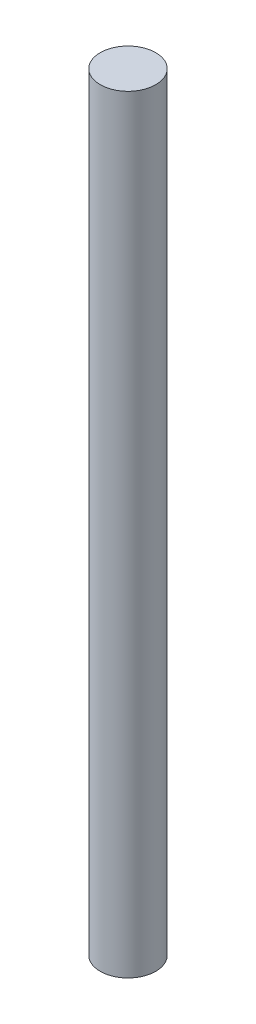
ISO-10303-21;
HEADER;
FILE_DESCRIPTION(('STEP AP214'),'2;1');
FILE_NAME('part.step','',(''),(''),'','','');
FILE_SCHEMA(('AUTOMOTIVE_DESIGN { 1 0 10303 214 1 1 1 1 }'));
ENDSEC;
DATA;
#1=APPLICATION_CONTEXT('core data for automotive mechanical design processes');
#2=APPLICATION_PROTOCOL_DEFINITION('international standard','automotive_design',2000,#1);
#3=PRODUCT_CONTEXT('',#1,'mechanical');
#4=PRODUCT('Part','Part','',(#3));
#5=PRODUCT_RELATED_PRODUCT_CATEGORY('part','',(#4));
#6=PRODUCT_DEFINITION_FORMATION('','',#4);
#7=PRODUCT_DEFINITION_CONTEXT('part definition',#1,'design');
#8=PRODUCT_DEFINITION('design','',#6,#7);
#9=PRODUCT_DEFINITION_SHAPE('','',#8);
#10=(LENGTH_UNIT() NAMED_UNIT(*) SI_UNIT(.MILLI.,.METRE.));
#11=(NAMED_UNIT(*) PLANE_ANGLE_UNIT() SI_UNIT($,.RADIAN.));
#12=(NAMED_UNIT(*) SI_UNIT($,.STERADIAN.) SOLID_ANGLE_UNIT());
#13=UNCERTAINTY_MEASURE_WITH_UNIT(LENGTH_MEASURE(1.E-05),#10,'distance_accuracy_value','');
#14=(GEOMETRIC_REPRESENTATION_CONTEXT(3) GLOBAL_UNCERTAINTY_ASSIGNED_CONTEXT((#13)) GLOBAL_UNIT_ASSIGNED_CONTEXT((#10,
#11,#12)) REPRESENTATION_CONTEXT('',''));
#15=CARTESIAN_POINT('',(0.,0.,0.));
#16=DIRECTION('',(0.,0.,1.));
#17=DIRECTION('',(1.,0.,0.));
#18=AXIS2_PLACEMENT_3D('',#15,#16,#17);
#19=CARTESIAN_POINT('',(2.22044604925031E-12,82.9999999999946,5.82867087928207E-13));
#20=DIRECTION('',(0.,-1.,0.));
#21=DIRECTION('',(0.,0.,-0.999999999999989));
#22=AXIS2_PLACEMENT_3D('',#19,#20,#21);
#23=CYLINDRICAL_SURFACE('',#22,3.);
#24=CARTESIAN_POINT('',(2.22044604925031E-12,82.9999999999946,5.82867087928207E-13));
#25=DIRECTION('',(0.,1.,0.));
#26=DIRECTION('',(0.,0.,0.999999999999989));
#27=AXIS2_PLACEMENT_3D('',#24,#25,#26);
#28=CIRCLE('',#27,3.);
#29=CARTESIAN_POINT('',(2.22061258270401E-12,82.9999999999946,3.00000000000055));
#30=VERTEX_POINT('',#29);
#31=EDGE_CURVE('E10',#30,#30,#28,.T.);
#32=ORIENTED_EDGE('',*,*,#31,.F.);
#33=EDGE_LOOP('',(#32));
#34=FACE_BOUND('',#33,.T.);
#35=CARTESIAN_POINT('',(1.72084568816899E-12,0.,3.60822483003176E-13));
#36=DIRECTION('',(0.,1.,0.));
#37=DIRECTION('',(0.,0.,0.999999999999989));
#38=AXIS2_PLACEMENT_3D('',#35,#36,#37);
#39=CIRCLE('',#38,3.);
#40=CARTESIAN_POINT('',(1.72101222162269E-12,0.,3.00000000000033));
#41=VERTEX_POINT('',#40);
#42=EDGE_CURVE('E53',#41,#41,#39,.T.);
#43=ORIENTED_EDGE('',*,*,#42,.T.);
#44=EDGE_LOOP('',(#43));
#45=FACE_BOUND('',#44,.T.);
#46=ADVANCED_FACE('F46',(#34,#45),#23,.T.);
#47=CARTESIAN_POINT('',(2.22044604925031E-12,82.9999999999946,5.82867087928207E-13));
#48=DIRECTION('',(0.,1.,0.));
#49=DIRECTION('',(0.,0.,0.999999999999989));
#50=AXIS2_PLACEMENT_3D('',#47,#48,#49);
#51=PLANE('',#50);
#52=ORIENTED_EDGE('',*,*,#31,.T.);
#53=EDGE_LOOP('',(#52));
#54=FACE_BOUND('',#53,.T.);
#55=ADVANCED_FACE('F63',(#54),#51,.T.);
#56=CARTESIAN_POINT('',(1.72084568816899E-12,0.,3.60822483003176E-13));
#57=DIRECTION('',(0.,1.,0.));
#58=DIRECTION('',(0.,0.,0.999999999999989));
#59=AXIS2_PLACEMENT_3D('',#56,#57,#58);
#60=PLANE('',#59);
#61=ORIENTED_EDGE('',*,*,#42,.F.);
#62=EDGE_LOOP('',(#61));
#63=FACE_BOUND('',#62,.T.);
#64=ADVANCED_FACE('F61',(#63),#60,.F.);
#65=CLOSED_SHELL('',(#46,#55,#64));
#66=MANIFOLD_SOLID_BREP('B2',#65);
#67=ADVANCED_BREP_SHAPE_REPRESENTATION('',(#18,#66),#14);
#68=SHAPE_DEFINITION_REPRESENTATION(#9,#67);
ENDSEC;
END-ISO-10303-21;
